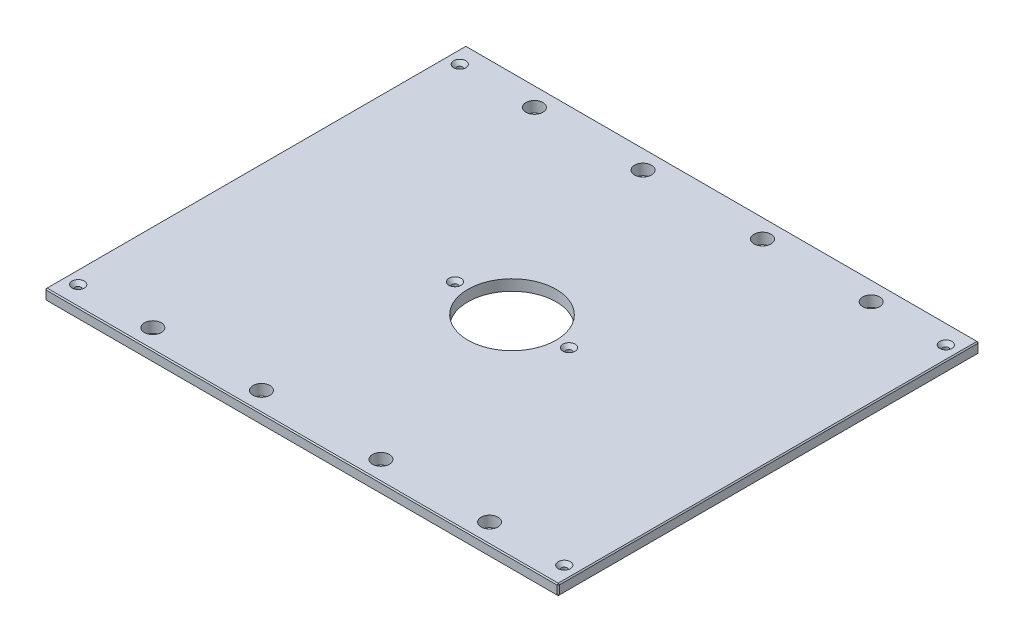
ISO-10303-21;
HEADER;
FILE_DESCRIPTION(('STEP AP214'),'2;1');
FILE_NAME('part.step','',(''),(''),'','','');
FILE_SCHEMA(('AUTOMOTIVE_DESIGN { 1 0 10303 214 1 1 1 1 }'));
ENDSEC;
DATA;
#1=APPLICATION_CONTEXT('core data for automotive mechanical design processes');
#2=APPLICATION_PROTOCOL_DEFINITION('international standard','automotive_design',2000,#1);
#3=PRODUCT_CONTEXT('',#1,'mechanical');
#4=PRODUCT('Part','Part','',(#3));
#5=PRODUCT_RELATED_PRODUCT_CATEGORY('part','',(#4));
#6=PRODUCT_DEFINITION_FORMATION('','',#4);
#7=PRODUCT_DEFINITION_CONTEXT('part definition',#1,'design');
#8=PRODUCT_DEFINITION('design','',#6,#7);
#9=PRODUCT_DEFINITION_SHAPE('','',#8);
#10=(LENGTH_UNIT() NAMED_UNIT(*) SI_UNIT(.MILLI.,.METRE.));
#11=(NAMED_UNIT(*) PLANE_ANGLE_UNIT() SI_UNIT($,.RADIAN.));
#12=(NAMED_UNIT(*) SI_UNIT($,.STERADIAN.) SOLID_ANGLE_UNIT());
#13=UNCERTAINTY_MEASURE_WITH_UNIT(LENGTH_MEASURE(1.E-05),#10,'distance_accuracy_value','');
#14=(GEOMETRIC_REPRESENTATION_CONTEXT(3) GLOBAL_UNCERTAINTY_ASSIGNED_CONTEXT((#13)) GLOBAL_UNIT_ASSIGNED_CONTEXT((#10,
#11,#12)) REPRESENTATION_CONTEXT('',''));
#15=CARTESIAN_POINT('',(0.,0.,0.));
#16=DIRECTION('',(0.,0.,1.));
#17=DIRECTION('',(1.,0.,0.));
#18=AXIS2_PLACEMENT_3D('',#15,#16,#17);
#19=CARTESIAN_POINT('',(-300.0375,12.7,-246.0625));
#20=DIRECTION('',(1.,0.,0.));
#21=DIRECTION('',(0.,0.,-1.));
#22=AXIS2_PLACEMENT_3D('',#19,#20,#21);
#23=PLANE('',#22);
#24=DIRECTION('',(0.,0.,-1.));
#25=VECTOR('',#24,1.);
#26=CARTESIAN_POINT('',(-300.0375,11.4300000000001,-246.0625));
#27=LINE('',#26,#25);
#28=CARTESIAN_POINT('',(-300.0375,11.4300000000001,244.7925));
#29=VERTEX_POINT('',#28);
#30=CARTESIAN_POINT('',(-300.0375,11.4300000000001,-244.7925));
#31=VERTEX_POINT('',#30);
#32=EDGE_CURVE('E135',#29,#31,#27,.T.);
#33=ORIENTED_EDGE('',*,*,#32,.T.);
#34=DIRECTION('',(0.,-1.,0.));
#35=VECTOR('',#34,1.);
#36=CARTESIAN_POINT('',(-300.0375,12.7,-244.7925));
#37=LINE('',#36,#35);
#38=CARTESIAN_POINT('',(-300.0375,1.26999999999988,-244.7925));
#39=VERTEX_POINT('',#38);
#40=EDGE_CURVE('E131',#31,#39,#37,.T.);
#41=ORIENTED_EDGE('',*,*,#40,.T.);
#42=DIRECTION('',(0.,0.,1.));
#43=VECTOR('',#42,1.);
#44=CARTESIAN_POINT('',(-300.0375,1.26999999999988,-246.0625));
#45=LINE('',#44,#43);
#46=CARTESIAN_POINT('',(-300.0375,1.26999999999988,244.7925));
#47=VERTEX_POINT('',#46);
#48=EDGE_CURVE('E126',#39,#47,#45,.T.);
#49=ORIENTED_EDGE('',*,*,#48,.T.);
#50=DIRECTION('',(0.,1.,0.));
#51=VECTOR('',#50,1.);
#52=CARTESIAN_POINT('',(-300.0375,12.7,244.7925));
#53=LINE('',#52,#51);
#54=EDGE_CURVE('E128',#47,#29,#53,.T.);
#55=ORIENTED_EDGE('',*,*,#54,.T.);
#56=EDGE_LOOP('',(#33,#41,#49,#55));
#57=FACE_BOUND('',#56,.T.);
#58=ADVANCED_FACE('F35',(#57),#23,.F.);
#59=CARTESIAN_POINT('',(-300.0375,12.7,246.0625));
#60=DIRECTION('',(0.,0.,-1.));
#61=DIRECTION('',(-1.,0.,0.));
#62=AXIS2_PLACEMENT_3D('',#59,#60,#61);
#63=PLANE('',#62);
#64=DIRECTION('',(1.,0.,0.));
#65=VECTOR('',#64,1.);
#66=CARTESIAN_POINT('',(-300.0375,1.26999999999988,246.0625));
#67=LINE('',#66,#65);
#68=CARTESIAN_POINT('',(-298.7675,1.26999999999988,246.0625));
#69=VERTEX_POINT('',#68);
#70=CARTESIAN_POINT('',(298.7675,1.26999999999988,246.0625));
#71=VERTEX_POINT('',#70);
#72=EDGE_CURVE('E58',#69,#71,#67,.T.);
#73=ORIENTED_EDGE('',*,*,#72,.T.);
#74=DIRECTION('',(0.,1.,0.));
#75=VECTOR('',#74,1.);
#76=CARTESIAN_POINT('',(298.7675,12.7,246.0625));
#77=LINE('',#76,#75);
#78=CARTESIAN_POINT('',(298.7675,11.4300000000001,246.0625));
#79=VERTEX_POINT('',#78);
#80=EDGE_CURVE('E11',#71,#79,#77,.T.);
#81=ORIENTED_EDGE('',*,*,#80,.T.);
#82=DIRECTION('',(-1.,0.,0.));
#83=VECTOR('',#82,1.);
#84=CARTESIAN_POINT('',(-300.0375,11.4300000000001,246.0625));
#85=LINE('',#84,#83);
#86=CARTESIAN_POINT('',(-298.7675,11.4300000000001,246.0625));
#87=VERTEX_POINT('',#86);
#88=EDGE_CURVE('E44',#79,#87,#85,.T.);
#89=ORIENTED_EDGE('',*,*,#88,.T.);
#90=DIRECTION('',(0.,-1.,0.));
#91=VECTOR('',#90,1.);
#92=CARTESIAN_POINT('',(-298.7675,12.7,246.0625));
#93=LINE('',#92,#91);
#94=EDGE_CURVE('E303',#87,#69,#93,.T.);
#95=ORIENTED_EDGE('',*,*,#94,.T.);
#96=EDGE_LOOP('',(#73,#81,#89,#95));
#97=FACE_BOUND('',#96,.T.);
#98=ADVANCED_FACE('F372',(#97),#63,.F.);
#99=CARTESIAN_POINT('',(300.0375,12.7,-246.0625));
#100=DIRECTION('',(-1.,0.,0.));
#101=DIRECTION('',(0.,0.,1.));
#102=AXIS2_PLACEMENT_3D('',#99,#100,#101);
#103=PLANE('',#102);
#104=DIRECTION('',(0.,0.,-1.));
#105=VECTOR('',#104,1.);
#106=CARTESIAN_POINT('',(300.0375,1.26999999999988,-246.0625));
#107=LINE('',#106,#105);
#108=CARTESIAN_POINT('',(300.0375,1.26999999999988,244.7925));
#109=VERTEX_POINT('',#108);
#110=CARTESIAN_POINT('',(300.0375,1.26999999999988,-244.7925));
#111=VERTEX_POINT('',#110);
#112=EDGE_CURVE('E298',#109,#111,#107,.T.);
#113=ORIENTED_EDGE('',*,*,#112,.T.);
#114=DIRECTION('',(0.,1.,0.));
#115=VECTOR('',#114,1.);
#116=CARTESIAN_POINT('',(300.0375,12.7,-244.7925));
#117=LINE('',#116,#115);
#118=CARTESIAN_POINT('',(300.0375,11.4300000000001,-244.7925));
#119=VERTEX_POINT('',#118);
#120=EDGE_CURVE('E300',#111,#119,#117,.T.);
#121=ORIENTED_EDGE('',*,*,#120,.T.);
#122=DIRECTION('',(0.,0.,1.));
#123=VECTOR('',#122,1.);
#124=CARTESIAN_POINT('',(300.0375,11.4300000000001,246.0625));
#125=LINE('',#124,#123);
#126=CARTESIAN_POINT('',(300.0375,11.4300000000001,244.7925));
#127=VERTEX_POINT('',#126);
#128=EDGE_CURVE('E296',#119,#127,#125,.T.);
#129=ORIENTED_EDGE('',*,*,#128,.T.);
#130=DIRECTION('',(0.,-1.,0.));
#131=VECTOR('',#130,1.);
#132=CARTESIAN_POINT('',(300.0375,12.7,244.7925));
#133=LINE('',#132,#131);
#134=EDGE_CURVE('E294',#127,#109,#133,.T.);
#135=ORIENTED_EDGE('',*,*,#134,.T.);
#136=EDGE_LOOP('',(#113,#121,#129,#135));
#137=FACE_BOUND('',#136,.T.);
#138=ADVANCED_FACE('F359',(#137),#103,.F.);
#139=CARTESIAN_POINT('',(-300.0375,12.7,-246.0625));
#140=DIRECTION('',(0.,0.,1.));
#141=DIRECTION('',(1.,0.,0.));
#142=AXIS2_PLACEMENT_3D('',#139,#140,#141);
#143=PLANE('',#142);
#144=DIRECTION('',(-1.,0.,0.));
#145=VECTOR('',#144,1.);
#146=CARTESIAN_POINT('',(-300.0375,1.26999999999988,-246.0625));
#147=LINE('',#146,#145);
#148=CARTESIAN_POINT('',(298.7675,1.26999999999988,-246.0625));
#149=VERTEX_POINT('',#148);
#150=CARTESIAN_POINT('',(-298.7675,1.26999999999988,-246.0625));
#151=VERTEX_POINT('',#150);
#152=EDGE_CURVE('E270',#149,#151,#147,.T.);
#153=ORIENTED_EDGE('',*,*,#152,.T.);
#154=DIRECTION('',(0.,1.,0.));
#155=VECTOR('',#154,1.);
#156=CARTESIAN_POINT('',(-298.7675,12.7,-246.0625));
#157=LINE('',#156,#155);
#158=CARTESIAN_POINT('',(-298.7675,11.4300000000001,-246.0625));
#159=VERTEX_POINT('',#158);
#160=EDGE_CURVE('E274',#151,#159,#157,.T.);
#161=ORIENTED_EDGE('',*,*,#160,.T.);
#162=DIRECTION('',(1.,0.,0.));
#163=VECTOR('',#162,1.);
#164=CARTESIAN_POINT('',(300.0375,11.4300000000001,-246.0625));
#165=LINE('',#164,#163);
#166=CARTESIAN_POINT('',(298.7675,11.4300000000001,-246.0625));
#167=VERTEX_POINT('',#166);
#168=EDGE_CURVE('E272',#159,#167,#165,.T.);
#169=ORIENTED_EDGE('',*,*,#168,.T.);
#170=DIRECTION('',(0.,-1.,0.));
#171=VECTOR('',#170,1.);
#172=CARTESIAN_POINT('',(298.7675,12.7,-246.0625));
#173=LINE('',#172,#171);
#174=EDGE_CURVE('E268',#167,#149,#173,.T.);
#175=ORIENTED_EDGE('',*,*,#174,.T.);
#176=EDGE_LOOP('',(#153,#161,#169,#175));
#177=FACE_BOUND('',#176,.T.);
#178=ADVANCED_FACE('F333',(#177),#143,.F.);
#179=CARTESIAN_POINT('',(0.,12.7,0.));
#180=DIRECTION('',(0.,1.,0.));
#181=DIRECTION('',(0.,0.,1.));
#182=AXIS2_PLACEMENT_3D('',#179,#180,#181);
#183=PLANE('',#182);
#184=CARTESIAN_POINT('',(284.1625,12.7,-223.04248));
#185=DIRECTION('',(0.,1.,0.));
#186=DIRECTION('',(0.,0.,1.));
#187=AXIS2_PLACEMENT_3D('',#184,#185,#186);
#188=CIRCLE('',#187,7.13740000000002);
#189=CARTESIAN_POINT('',(284.1625,12.7,-215.90508));
#190=VERTEX_POINT('',#189);
#191=EDGE_CURVE('E816',#190,#190,#188,.T.);
#192=ORIENTED_EDGE('',*,*,#191,.F.);
#193=EDGE_LOOP('',(#192));
#194=FACE_BOUND('',#193,.T.);
#195=CARTESIAN_POINT('',(284.1625,12.7,223.04248));
#196=DIRECTION('',(0.,1.,0.));
#197=DIRECTION('',(0.,0.,1.));
#198=AXIS2_PLACEMENT_3D('',#195,#196,#197);
#199=CIRCLE('',#198,7.13740000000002);
#200=CARTESIAN_POINT('',(284.1625,12.7,230.17988));
#201=VERTEX_POINT('',#200);
#202=EDGE_CURVE('E820',#201,#201,#199,.T.);
#203=ORIENTED_EDGE('',*,*,#202,.F.);
#204=EDGE_LOOP('',(#203));
#205=FACE_BOUND('',#204,.T.);
#206=CARTESIAN_POINT('',(-284.1625,12.7,223.04248));
#207=DIRECTION('',(0.,1.,0.));
#208=DIRECTION('',(0.,0.,1.));
#209=AXIS2_PLACEMENT_3D('',#206,#207,#208);
#210=CIRCLE('',#209,7.13740000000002);
#211=CARTESIAN_POINT('',(-284.1625,12.7,230.17988));
#212=VERTEX_POINT('',#211);
#213=EDGE_CURVE('E824',#212,#212,#210,.T.);
#214=ORIENTED_EDGE('',*,*,#213,.F.);
#215=EDGE_LOOP('',(#214));
#216=FACE_BOUND('',#215,.T.);
#217=CARTESIAN_POINT('',(-66.675,12.7,0.));
#218=DIRECTION('',(0.,1.,0.));
#219=DIRECTION('',(0.,0.,1.));
#220=AXIS2_PLACEMENT_3D('',#217,#218,#219);
#221=CIRCLE('',#220,7.1374);
#222=CARTESIAN_POINT('',(-66.675,12.7,7.1374));
#223=VERTEX_POINT('',#222);
#224=EDGE_CURVE('E828',#223,#223,#221,.T.);
#225=ORIENTED_EDGE('',*,*,#224,.F.);
#226=EDGE_LOOP('',(#225));
#227=FACE_BOUND('',#226,.T.);
#228=CARTESIAN_POINT('',(66.675,12.7,0.));
#229=DIRECTION('',(0.,1.,0.));
#230=DIRECTION('',(0.,0.,1.));
#231=AXIS2_PLACEMENT_3D('',#228,#229,#230);
#232=CIRCLE('',#231,7.1374);
#233=CARTESIAN_POINT('',(66.675,12.7,7.1374));
#234=VERTEX_POINT('',#233);
#235=EDGE_CURVE('E832',#234,#234,#232,.T.);
#236=ORIENTED_EDGE('',*,*,#235,.F.);
#237=EDGE_LOOP('',(#236));
#238=FACE_BOUND('',#237,.T.);
#239=CARTESIAN_POINT('',(-284.1625,12.7,-223.04248));
#240=DIRECTION('',(0.,1.,0.));
#241=DIRECTION('',(0.,0.,1.));
#242=AXIS2_PLACEMENT_3D('',#239,#240,#241);
#243=CIRCLE('',#242,7.13740000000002);
#244=CARTESIAN_POINT('',(-284.1625,12.7,-215.90508));
#245=VERTEX_POINT('',#244);
#246=EDGE_CURVE('E835',#245,#245,#243,.T.);
#247=ORIENTED_EDGE('',*,*,#246,.F.);
#248=EDGE_LOOP('',(#247));
#249=FACE_BOUND('',#248,.T.);
#250=DIRECTION('',(0.,0.,-1.));
#251=VECTOR('',#250,1.);
#252=CARTESIAN_POINT('',(298.7675,12.7,-246.0625));
#253=LINE('',#252,#251);
#254=CARTESIAN_POINT('',(298.7675,12.7,244.7925));
#255=VERTEX_POINT('',#254);
#256=CARTESIAN_POINT('',(298.7675,12.7,-244.7925));
#257=VERTEX_POINT('',#256);
#258=EDGE_CURVE('E281',#255,#257,#253,.T.);
#259=ORIENTED_EDGE('',*,*,#258,.T.);
#260=DIRECTION('',(-1.,0.,0.));
#261=VECTOR('',#260,1.);
#262=CARTESIAN_POINT('',(-300.0375,12.7,-244.7925));
#263=LINE('',#262,#261);
#264=CARTESIAN_POINT('',(-298.7675,12.7,-244.7925));
#265=VERTEX_POINT('',#264);
#266=EDGE_CURVE('E283',#257,#265,#263,.T.);
#267=ORIENTED_EDGE('',*,*,#266,.T.);
#268=DIRECTION('',(0.,0.,1.));
#269=VECTOR('',#268,1.);
#270=CARTESIAN_POINT('',(-298.7675,12.7,246.0625));
#271=LINE('',#270,#269);
#272=CARTESIAN_POINT('',(-298.7675,12.7,244.7925));
#273=VERTEX_POINT('',#272);
#274=EDGE_CURVE('E279',#265,#273,#271,.T.);
#275=ORIENTED_EDGE('',*,*,#274,.T.);
#276=DIRECTION('',(1.,0.,0.));
#277=VECTOR('',#276,1.);
#278=CARTESIAN_POINT('',(300.0375,12.7,244.7925));
#279=LINE('',#278,#277);
#280=EDGE_CURVE('E277',#273,#255,#279,.T.);
#281=ORIENTED_EDGE('',*,*,#280,.T.);
#282=EDGE_LOOP('',(#259,#267,#275,#281));
#283=FACE_BOUND('',#282,.T.);
#284=CARTESIAN_POINT('',(196.85,12.7,-223.04248));
#285=DIRECTION('',(0.,1.,0.));
#286=DIRECTION('',(0.,0.,1.));
#287=AXIS2_PLACEMENT_3D('',#284,#285,#286);
#288=CIRCLE('',#287,9.921875);
#289=CARTESIAN_POINT('',(196.85,12.7,-213.120605));
#290=VERTEX_POINT('',#289);
#291=EDGE_CURVE('E204',#290,#290,#288,.T.);
#292=ORIENTED_EDGE('',*,*,#291,.F.);
#293=EDGE_LOOP('',(#292));
#294=FACE_BOUND('',#293,.T.);
#295=CARTESIAN_POINT('',(-196.85,12.7,-223.04248));
#296=DIRECTION('',(0.,1.,0.));
#297=DIRECTION('',(0.,0.,1.));
#298=AXIS2_PLACEMENT_3D('',#295,#296,#297);
#299=CIRCLE('',#298,9.921875);
#300=CARTESIAN_POINT('',(-196.85,12.7,-213.120605));
#301=VERTEX_POINT('',#300);
#302=EDGE_CURVE('E214',#301,#301,#299,.T.);
#303=ORIENTED_EDGE('',*,*,#302,.F.);
#304=EDGE_LOOP('',(#303));
#305=FACE_BOUND('',#304,.T.);
#306=CARTESIAN_POINT('',(196.85,12.7,223.04248));
#307=DIRECTION('',(0.,1.,0.));
#308=DIRECTION('',(0.,0.,1.));
#309=AXIS2_PLACEMENT_3D('',#306,#307,#308);
#310=CIRCLE('',#309,9.921875);
#311=CARTESIAN_POINT('',(196.85,12.7,232.964355));
#312=VERTEX_POINT('',#311);
#313=EDGE_CURVE('E225',#312,#312,#310,.T.);
#314=ORIENTED_EDGE('',*,*,#313,.F.);
#315=EDGE_LOOP('',(#314));
#316=FACE_BOUND('',#315,.T.);
#317=CARTESIAN_POINT('',(-196.85,12.7,223.04248));
#318=DIRECTION('',(0.,1.,0.));
#319=DIRECTION('',(0.,0.,1.));
#320=AXIS2_PLACEMENT_3D('',#317,#318,#319);
#321=CIRCLE('',#320,9.921875);
#322=CARTESIAN_POINT('',(-196.85,12.7,232.964355));
#323=VERTEX_POINT('',#322);
#324=EDGE_CURVE('E231',#323,#323,#321,.T.);
#325=ORIENTED_EDGE('',*,*,#324,.F.);
#326=EDGE_LOOP('',(#325));
#327=FACE_BOUND('',#326,.T.);
#328=CARTESIAN_POINT('',(-69.85,12.7,-223.04248));
#329=DIRECTION('',(0.,1.,0.));
#330=DIRECTION('',(0.,0.,1.));
#331=AXIS2_PLACEMENT_3D('',#328,#329,#330);
#332=CIRCLE('',#331,9.921875);
#333=CARTESIAN_POINT('',(-69.85,12.7,-213.120605));
#334=VERTEX_POINT('',#333);
#335=EDGE_CURVE('E237',#334,#334,#332,.T.);
#336=ORIENTED_EDGE('',*,*,#335,.F.);
#337=EDGE_LOOP('',(#336));
#338=FACE_BOUND('',#337,.T.);
#339=CARTESIAN_POINT('',(69.85,12.7,-223.04248));
#340=DIRECTION('',(0.,1.,0.));
#341=DIRECTION('',(0.,0.,1.));
#342=AXIS2_PLACEMENT_3D('',#339,#340,#341);
#343=CIRCLE('',#342,9.921875);
#344=CARTESIAN_POINT('',(69.85,12.7,-213.120605));
#345=VERTEX_POINT('',#344);
#346=EDGE_CURVE('E243',#345,#345,#343,.T.);
#347=ORIENTED_EDGE('',*,*,#346,.F.);
#348=EDGE_LOOP('',(#347));
#349=FACE_BOUND('',#348,.T.);
#350=CARTESIAN_POINT('',(69.85,12.7,223.04248));
#351=DIRECTION('',(0.,1.,0.));
#352=DIRECTION('',(0.,0.,1.));
#353=AXIS2_PLACEMENT_3D('',#350,#351,#352);
#354=CIRCLE('',#353,9.921875);
#355=CARTESIAN_POINT('',(69.85,12.7,232.964355));
#356=VERTEX_POINT('',#355);
#357=EDGE_CURVE('E249',#356,#356,#354,.T.);
#358=ORIENTED_EDGE('',*,*,#357,.F.);
#359=EDGE_LOOP('',(#358));
#360=FACE_BOUND('',#359,.T.);
#361=CARTESIAN_POINT('',(-69.85,12.7,223.04248));
#362=DIRECTION('',(0.,1.,0.));
#363=DIRECTION('',(0.,0.,1.));
#364=AXIS2_PLACEMENT_3D('',#361,#362,#363);
#365=CIRCLE('',#364,9.921875);
#366=CARTESIAN_POINT('',(-69.85,12.7,232.964355));
#367=VERTEX_POINT('',#366);
#368=EDGE_CURVE('E255',#367,#367,#365,.T.);
#369=ORIENTED_EDGE('',*,*,#368,.F.);
#370=EDGE_LOOP('',(#369));
#371=FACE_BOUND('',#370,.T.);
#372=CARTESIAN_POINT('',(0.,12.7,0.));
#373=DIRECTION('',(0.,1.,0.));
#374=DIRECTION('',(0.,0.,1.));
#375=AXIS2_PLACEMENT_3D('',#372,#373,#374);
#376=CIRCLE('',#375,51.562);
#377=CARTESIAN_POINT('',(0.,12.7,51.562));
#378=VERTEX_POINT('',#377);
#379=EDGE_CURVE('E261',#378,#378,#376,.T.);
#380=ORIENTED_EDGE('',*,*,#379,.F.);
#381=EDGE_LOOP('',(#380));
#382=FACE_BOUND('',#381,.T.);
#383=ADVANCED_FACE('F381',(#194,#205,#216,#227,#238,#249,#283,#294,#305,#316,#327,#338,#349,
#360,#371,#382),#183,.T.);
#384=CARTESIAN_POINT('',(0.,0.,0.));
#385=DIRECTION('',(0.,1.,0.));
#386=DIRECTION('',(0.,0.,1.));
#387=AXIS2_PLACEMENT_3D('',#384,#385,#386);
#388=PLANE('',#387);
#389=CARTESIAN_POINT('',(284.1625,0.,-223.04248));
#390=DIRECTION('',(0.,1.,0.));
#391=DIRECTION('',(0.,0.,1.));
#392=AXIS2_PLACEMENT_3D('',#389,#390,#391);
#393=CIRCLE('',#392,3.3782);
#394=CARTESIAN_POINT('',(284.1625,0.,-219.66428));
#395=VERTEX_POINT('',#394);
#396=EDGE_CURVE('E869',#395,#395,#393,.T.);
#397=ORIENTED_EDGE('',*,*,#396,.T.);
#398=EDGE_LOOP('',(#397));
#399=FACE_BOUND('',#398,.T.);
#400=CARTESIAN_POINT('',(284.1625,0.,223.04248));
#401=DIRECTION('',(0.,1.,0.));
#402=DIRECTION('',(0.,0.,1.));
#403=AXIS2_PLACEMENT_3D('',#400,#401,#402);
#404=CIRCLE('',#403,3.3782);
#405=CARTESIAN_POINT('',(284.1625,0.,226.42068));
#406=VERTEX_POINT('',#405);
#407=EDGE_CURVE('E862',#406,#406,#404,.T.);
#408=ORIENTED_EDGE('',*,*,#407,.T.);
#409=EDGE_LOOP('',(#408));
#410=FACE_BOUND('',#409,.T.);
#411=CARTESIAN_POINT('',(-284.1625,0.,223.04248));
#412=DIRECTION('',(0.,1.,0.));
#413=DIRECTION('',(0.,0.,1.));
#414=AXIS2_PLACEMENT_3D('',#411,#412,#413);
#415=CIRCLE('',#414,3.3782);
#416=CARTESIAN_POINT('',(-284.1625,0.,226.42068));
#417=VERTEX_POINT('',#416);
#418=EDGE_CURVE('E855',#417,#417,#415,.T.);
#419=ORIENTED_EDGE('',*,*,#418,.T.);
#420=EDGE_LOOP('',(#419));
#421=FACE_BOUND('',#420,.T.);
#422=CARTESIAN_POINT('',(-66.675,0.,0.));
#423=DIRECTION('',(0.,1.,0.));
#424=DIRECTION('',(0.,0.,1.));
#425=AXIS2_PLACEMENT_3D('',#422,#423,#424);
#426=CIRCLE('',#425,3.3782);
#427=CARTESIAN_POINT('',(-66.675,0.,3.3782));
#428=VERTEX_POINT('',#427);
#429=EDGE_CURVE('E848',#428,#428,#426,.T.);
#430=ORIENTED_EDGE('',*,*,#429,.T.);
#431=EDGE_LOOP('',(#430));
#432=FACE_BOUND('',#431,.T.);
#433=CARTESIAN_POINT('',(66.675,0.,0.));
#434=DIRECTION('',(0.,1.,0.));
#435=DIRECTION('',(0.,0.,1.));
#436=AXIS2_PLACEMENT_3D('',#433,#434,#435);
#437=CIRCLE('',#436,3.3782);
#438=CARTESIAN_POINT('',(66.675,0.,3.3782));
#439=VERTEX_POINT('',#438);
#440=EDGE_CURVE('E838',#439,#439,#437,.T.);
#441=ORIENTED_EDGE('',*,*,#440,.T.);
#442=EDGE_LOOP('',(#441));
#443=FACE_BOUND('',#442,.T.);
#444=CARTESIAN_POINT('',(-284.1625,0.,-223.04248));
#445=DIRECTION('',(0.,1.,0.));
#446=DIRECTION('',(0.,0.,1.));
#447=AXIS2_PLACEMENT_3D('',#444,#445,#446);
#448=CIRCLE('',#447,3.3782);
#449=CARTESIAN_POINT('',(-284.1625,0.,-219.66428));
#450=VERTEX_POINT('',#449);
#451=EDGE_CURVE('E217',#450,#450,#448,.T.);
#452=ORIENTED_EDGE('',*,*,#451,.T.);
#453=EDGE_LOOP('',(#452));
#454=FACE_BOUND('',#453,.T.);
#455=DIRECTION('',(0.,0.,-1.));
#456=VECTOR('',#455,1.);
#457=CARTESIAN_POINT('',(-298.7675,0.,0.));
#458=LINE('',#457,#456);
#459=CARTESIAN_POINT('',(-298.7675,0.,244.7925));
#460=VERTEX_POINT('',#459);
#461=CARTESIAN_POINT('',(-298.7675,0.,-244.7925));
#462=VERTEX_POINT('',#461);
#463=EDGE_CURVE('E158',#460,#462,#458,.T.);
#464=ORIENTED_EDGE('',*,*,#463,.T.);
#465=DIRECTION('',(1.,0.,0.));
#466=VECTOR('',#465,1.);
#467=CARTESIAN_POINT('',(0.,0.,-244.7925));
#468=LINE('',#467,#466);
#469=CARTESIAN_POINT('',(298.7675,0.,-244.7925));
#470=VERTEX_POINT('',#469);
#471=EDGE_CURVE('E291',#462,#470,#468,.T.);
#472=ORIENTED_EDGE('',*,*,#471,.T.);
#473=DIRECTION('',(0.,0.,1.));
#474=VECTOR('',#473,1.);
#475=CARTESIAN_POINT('',(298.7675,0.,0.));
#476=LINE('',#475,#474);
#477=CARTESIAN_POINT('',(298.7675,0.,244.7925));
#478=VERTEX_POINT('',#477);
#479=EDGE_CURVE('E289',#470,#478,#476,.T.);
#480=ORIENTED_EDGE('',*,*,#479,.T.);
#481=DIRECTION('',(-1.,0.,0.));
#482=VECTOR('',#481,1.);
#483=CARTESIAN_POINT('',(0.,0.,244.7925));
#484=LINE('',#483,#482);
#485=EDGE_CURVE('E286',#478,#460,#484,.T.);
#486=ORIENTED_EDGE('',*,*,#485,.T.);
#487=EDGE_LOOP('',(#464,#472,#480,#486));
#488=FACE_BOUND('',#487,.T.);
#489=CARTESIAN_POINT('',(196.85,0.,-223.04248));
#490=DIRECTION('',(0.,1.,0.));
#491=DIRECTION('',(0.,0.,1.));
#492=AXIS2_PLACEMENT_3D('',#489,#490,#491);
#493=CIRCLE('',#492,9.921875);
#494=CARTESIAN_POINT('',(196.85,0.,-213.120605));
#495=VERTEX_POINT('',#494);
#496=EDGE_CURVE('E209',#495,#495,#493,.T.);
#497=ORIENTED_EDGE('',*,*,#496,.T.);
#498=EDGE_LOOP('',(#497));
#499=FACE_BOUND('',#498,.T.);
#500=CARTESIAN_POINT('',(-196.85,0.,-223.04248));
#501=DIRECTION('',(0.,1.,0.));
#502=DIRECTION('',(0.,0.,1.));
#503=AXIS2_PLACEMENT_3D('',#500,#501,#502);
#504=CIRCLE('',#503,9.921875);
#505=CARTESIAN_POINT('',(-196.85,0.,-213.120605));
#506=VERTEX_POINT('',#505);
#507=EDGE_CURVE('E222',#506,#506,#504,.T.);
#508=ORIENTED_EDGE('',*,*,#507,.T.);
#509=EDGE_LOOP('',(#508));
#510=FACE_BOUND('',#509,.T.);
#511=CARTESIAN_POINT('',(196.85,0.,223.04248));
#512=DIRECTION('',(0.,1.,0.));
#513=DIRECTION('',(0.,0.,1.));
#514=AXIS2_PLACEMENT_3D('',#511,#512,#513);
#515=CIRCLE('',#514,9.921875);
#516=CARTESIAN_POINT('',(196.85,0.,232.964355));
#517=VERTEX_POINT('',#516);
#518=EDGE_CURVE('E228',#517,#517,#515,.T.);
#519=ORIENTED_EDGE('',*,*,#518,.T.);
#520=EDGE_LOOP('',(#519));
#521=FACE_BOUND('',#520,.T.);
#522=CARTESIAN_POINT('',(-196.85,0.,223.04248));
#523=DIRECTION('',(0.,1.,0.));
#524=DIRECTION('',(0.,0.,1.));
#525=AXIS2_PLACEMENT_3D('',#522,#523,#524);
#526=CIRCLE('',#525,9.921875);
#527=CARTESIAN_POINT('',(-196.85,0.,232.964355));
#528=VERTEX_POINT('',#527);
#529=EDGE_CURVE('E234',#528,#528,#526,.T.);
#530=ORIENTED_EDGE('',*,*,#529,.T.);
#531=EDGE_LOOP('',(#530));
#532=FACE_BOUND('',#531,.T.);
#533=CARTESIAN_POINT('',(-69.85,0.,-223.04248));
#534=DIRECTION('',(0.,1.,0.));
#535=DIRECTION('',(0.,0.,1.));
#536=AXIS2_PLACEMENT_3D('',#533,#534,#535);
#537=CIRCLE('',#536,9.921875);
#538=CARTESIAN_POINT('',(-69.85,0.,-213.120605));
#539=VERTEX_POINT('',#538);
#540=EDGE_CURVE('E240',#539,#539,#537,.T.);
#541=ORIENTED_EDGE('',*,*,#540,.T.);
#542=EDGE_LOOP('',(#541));
#543=FACE_BOUND('',#542,.T.);
#544=CARTESIAN_POINT('',(69.85,0.,-223.04248));
#545=DIRECTION('',(0.,1.,0.));
#546=DIRECTION('',(0.,0.,1.));
#547=AXIS2_PLACEMENT_3D('',#544,#545,#546);
#548=CIRCLE('',#547,9.921875);
#549=CARTESIAN_POINT('',(69.85,0.,-213.120605));
#550=VERTEX_POINT('',#549);
#551=EDGE_CURVE('E246',#550,#550,#548,.T.);
#552=ORIENTED_EDGE('',*,*,#551,.T.);
#553=EDGE_LOOP('',(#552));
#554=FACE_BOUND('',#553,.T.);
#555=CARTESIAN_POINT('',(69.85,0.,223.04248));
#556=DIRECTION('',(0.,1.,0.));
#557=DIRECTION('',(0.,0.,1.));
#558=AXIS2_PLACEMENT_3D('',#555,#556,#557);
#559=CIRCLE('',#558,9.921875);
#560=CARTESIAN_POINT('',(69.85,0.,232.964355));
#561=VERTEX_POINT('',#560);
#562=EDGE_CURVE('E252',#561,#561,#559,.T.);
#563=ORIENTED_EDGE('',*,*,#562,.T.);
#564=EDGE_LOOP('',(#563));
#565=FACE_BOUND('',#564,.T.);
#566=CARTESIAN_POINT('',(-69.85,0.,223.04248));
#567=DIRECTION('',(0.,1.,0.));
#568=DIRECTION('',(0.,0.,1.));
#569=AXIS2_PLACEMENT_3D('',#566,#567,#568);
#570=CIRCLE('',#569,9.921875);
#571=CARTESIAN_POINT('',(-69.85,0.,232.964355));
#572=VERTEX_POINT('',#571);
#573=EDGE_CURVE('E258',#572,#572,#570,.T.);
#574=ORIENTED_EDGE('',*,*,#573,.T.);
#575=EDGE_LOOP('',(#574));
#576=FACE_BOUND('',#575,.T.);
#577=CARTESIAN_POINT('',(0.,0.,0.));
#578=DIRECTION('',(0.,1.,0.));
#579=DIRECTION('',(0.,0.,1.));
#580=AXIS2_PLACEMENT_3D('',#577,#578,#579);
#581=CIRCLE('',#580,51.562);
#582=CARTESIAN_POINT('',(0.,0.,51.562));
#583=VERTEX_POINT('',#582);
#584=EDGE_CURVE('E147',#583,#583,#581,.T.);
#585=ORIENTED_EDGE('',*,*,#584,.T.);
#586=EDGE_LOOP('',(#585));
#587=FACE_BOUND('',#586,.T.);
#588=ADVANCED_FACE('F346',(#399,#410,#421,#432,#443,#454,#488,#499,#510,#521,#532,#543,#554,
#565,#576,#587),#388,.F.);
#589=CARTESIAN_POINT('',(0.,0.,0.));
#590=DIRECTION('',(0.,1.,0.));
#591=DIRECTION('',(0.,0.,1.));
#592=AXIS2_PLACEMENT_3D('',#589,#590,#591);
#593=CYLINDRICAL_SURFACE('',#592,51.562);
#594=ORIENTED_EDGE('',*,*,#584,.F.);
#595=EDGE_LOOP('',(#594));
#596=FACE_BOUND('',#595,.T.);
#597=ORIENTED_EDGE('',*,*,#379,.T.);
#598=EDGE_LOOP('',(#597));
#599=FACE_BOUND('',#598,.T.);
#600=ADVANCED_FACE('F751',(#596,#599),#593,.F.);
#601=CARTESIAN_POINT('',(-69.85,12.7,223.04248));
#602=DIRECTION('',(0.,1.,0.));
#603=DIRECTION('',(0.,0.,1.));
#604=AXIS2_PLACEMENT_3D('',#601,#602,#603);
#605=CYLINDRICAL_SURFACE('',#604,9.921875);
#606=ORIENTED_EDGE('',*,*,#573,.F.);
#607=EDGE_LOOP('',(#606));
#608=FACE_BOUND('',#607,.T.);
#609=ORIENTED_EDGE('',*,*,#368,.T.);
#610=EDGE_LOOP('',(#609));
#611=FACE_BOUND('',#610,.T.);
#612=ADVANCED_FACE('F742',(#608,#611),#605,.F.);
#613=CARTESIAN_POINT('',(69.85,12.7,223.04248));
#614=DIRECTION('',(0.,1.,0.));
#615=DIRECTION('',(0.,0.,1.));
#616=AXIS2_PLACEMENT_3D('',#613,#614,#615);
#617=CYLINDRICAL_SURFACE('',#616,9.921875);
#618=ORIENTED_EDGE('',*,*,#562,.F.);
#619=EDGE_LOOP('',(#618));
#620=FACE_BOUND('',#619,.T.);
#621=ORIENTED_EDGE('',*,*,#357,.T.);
#622=EDGE_LOOP('',(#621));
#623=FACE_BOUND('',#622,.T.);
#624=ADVANCED_FACE('F733',(#620,#623),#617,.F.);
#625=CARTESIAN_POINT('',(69.85,12.7,-223.04248));
#626=DIRECTION('',(0.,1.,0.));
#627=DIRECTION('',(0.,0.,1.));
#628=AXIS2_PLACEMENT_3D('',#625,#626,#627);
#629=CYLINDRICAL_SURFACE('',#628,9.921875);
#630=ORIENTED_EDGE('',*,*,#551,.F.);
#631=EDGE_LOOP('',(#630));
#632=FACE_BOUND('',#631,.T.);
#633=ORIENTED_EDGE('',*,*,#346,.T.);
#634=EDGE_LOOP('',(#633));
#635=FACE_BOUND('',#634,.T.);
#636=ADVANCED_FACE('F724',(#632,#635),#629,.F.);
#637=CARTESIAN_POINT('',(-69.85,12.7,-223.04248));
#638=DIRECTION('',(0.,1.,0.));
#639=DIRECTION('',(0.,0.,1.));
#640=AXIS2_PLACEMENT_3D('',#637,#638,#639);
#641=CYLINDRICAL_SURFACE('',#640,9.921875);
#642=ORIENTED_EDGE('',*,*,#540,.F.);
#643=EDGE_LOOP('',(#642));
#644=FACE_BOUND('',#643,.T.);
#645=ORIENTED_EDGE('',*,*,#335,.T.);
#646=EDGE_LOOP('',(#645));
#647=FACE_BOUND('',#646,.T.);
#648=ADVANCED_FACE('F715',(#644,#647),#641,.F.);
#649=CARTESIAN_POINT('',(-196.85,12.7,223.04248));
#650=DIRECTION('',(0.,1.,0.));
#651=DIRECTION('',(0.,0.,1.));
#652=AXIS2_PLACEMENT_3D('',#649,#650,#651);
#653=CYLINDRICAL_SURFACE('',#652,9.921875);
#654=ORIENTED_EDGE('',*,*,#529,.F.);
#655=EDGE_LOOP('',(#654));
#656=FACE_BOUND('',#655,.T.);
#657=ORIENTED_EDGE('',*,*,#324,.T.);
#658=EDGE_LOOP('',(#657));
#659=FACE_BOUND('',#658,.T.);
#660=ADVANCED_FACE('F706',(#656,#659),#653,.F.);
#661=CARTESIAN_POINT('',(196.85,12.7,223.04248));
#662=DIRECTION('',(0.,1.,0.));
#663=DIRECTION('',(0.,0.,1.));
#664=AXIS2_PLACEMENT_3D('',#661,#662,#663);
#665=CYLINDRICAL_SURFACE('',#664,9.921875);
#666=ORIENTED_EDGE('',*,*,#518,.F.);
#667=EDGE_LOOP('',(#666));
#668=FACE_BOUND('',#667,.T.);
#669=ORIENTED_EDGE('',*,*,#313,.T.);
#670=EDGE_LOOP('',(#669));
#671=FACE_BOUND('',#670,.T.);
#672=ADVANCED_FACE('F697',(#668,#671),#665,.F.);
#673=CARTESIAN_POINT('',(-196.85,12.7,-223.04248));
#674=DIRECTION('',(0.,1.,0.));
#675=DIRECTION('',(0.,0.,1.));
#676=AXIS2_PLACEMENT_3D('',#673,#674,#675);
#677=CYLINDRICAL_SURFACE('',#676,9.921875);
#678=ORIENTED_EDGE('',*,*,#507,.F.);
#679=EDGE_LOOP('',(#678));
#680=FACE_BOUND('',#679,.T.);
#681=ORIENTED_EDGE('',*,*,#302,.T.);
#682=EDGE_LOOP('',(#681));
#683=FACE_BOUND('',#682,.T.);
#684=ADVANCED_FACE('F687',(#680,#683),#677,.F.);
#685=CARTESIAN_POINT('',(196.85,12.7,-223.04248));
#686=DIRECTION('',(0.,1.,0.));
#687=DIRECTION('',(0.,0.,1.));
#688=AXIS2_PLACEMENT_3D('',#685,#686,#687);
#689=CYLINDRICAL_SURFACE('',#688,9.921875);
#690=ORIENTED_EDGE('',*,*,#496,.F.);
#691=EDGE_LOOP('',(#690));
#692=FACE_BOUND('',#691,.T.);
#693=ORIENTED_EDGE('',*,*,#291,.T.);
#694=EDGE_LOOP('',(#693));
#695=FACE_BOUND('',#694,.T.);
#696=ADVANCED_FACE('F390',(#692,#695),#689,.F.);
#697=CARTESIAN_POINT('',(300.0375,12.7,244.7925));
#698=DIRECTION('',(-0.707106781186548,0.,-0.707106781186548));
#699=DIRECTION('',(0.,-1.,0.));
#700=AXIS2_PLACEMENT_3D('',#697,#698,#699);
#701=PLANE('',#700);
#702=DIRECTION('',(-0.707106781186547,0.,0.707106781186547));
#703=VECTOR('',#702,1.);
#704=CARTESIAN_POINT('',(300.0375,11.4300000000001,244.7925));
#705=LINE('',#704,#703);
#706=EDGE_CURVE('E39',#79,#127,#705,.F.);
#707=ORIENTED_EDGE('',*,*,#706,.F.);
#708=ORIENTED_EDGE('',*,*,#80,.F.);
#709=DIRECTION('',(0.707106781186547,0.,-0.707106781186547));
#710=VECTOR('',#709,1.);
#711=CARTESIAN_POINT('',(299.4025,1.26999999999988,245.4275));
#712=LINE('',#711,#710);
#713=EDGE_CURVE('E197',#109,#71,#712,.F.);
#714=ORIENTED_EDGE('',*,*,#713,.F.);
#715=ORIENTED_EDGE('',*,*,#134,.F.);
#716=EDGE_LOOP('',(#707,#708,#714,#715));
#717=FACE_BOUND('',#716,.T.);
#718=ADVANCED_FACE('F37',(#717),#701,.F.);
#719=CARTESIAN_POINT('',(300.0375,11.4300000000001,244.7925));
#720=DIRECTION('',(0.577350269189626,0.577350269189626,0.577350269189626));
#721=DIRECTION('',(0.707106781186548,0.,-0.707106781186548));
#722=AXIS2_PLACEMENT_3D('',#719,#720,#721);
#723=PLANE('',#722);
#724=DIRECTION('',(0.,-0.707106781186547,0.707106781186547));
#725=VECTOR('',#724,1.);
#726=CARTESIAN_POINT('',(298.7675,12.0650000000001,245.4275));
#727=LINE('',#726,#725);
#728=EDGE_CURVE('E193',#79,#255,#727,.F.);
#729=ORIENTED_EDGE('',*,*,#728,.F.);
#730=ORIENTED_EDGE('',*,*,#706,.T.);
#731=DIRECTION('',(-0.707106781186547,0.707106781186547,0.));
#732=VECTOR('',#731,1.);
#733=CARTESIAN_POINT('',(300.0375,11.4300000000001,244.7925));
#734=LINE('',#733,#732);
#735=EDGE_CURVE('E195',#255,#127,#734,.F.);
#736=ORIENTED_EDGE('',*,*,#735,.F.);
#737=EDGE_LOOP('',(#729,#730,#736));
#738=FACE_BOUND('',#737,.T.);
#739=ADVANCED_FACE('F383',(#738),#723,.T.);
#740=CARTESIAN_POINT('',(298.7675,0.,244.7925));
#741=DIRECTION('',(0.577350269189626,-0.577350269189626,0.577350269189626));
#742=DIRECTION('',(0.707106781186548,0.,-0.707106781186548));
#743=AXIS2_PLACEMENT_3D('',#740,#741,#742);
#744=PLANE('',#743);
#745=DIRECTION('',(-0.707106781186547,-0.707106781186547,0.));
#746=VECTOR('',#745,1.);
#747=CARTESIAN_POINT('',(298.7675,0.,244.7925));
#748=LINE('',#747,#746);
#749=EDGE_CURVE('E187',#109,#478,#748,.T.);
#750=ORIENTED_EDGE('',*,*,#749,.F.);
#751=ORIENTED_EDGE('',*,*,#713,.T.);
#752=DIRECTION('',(0.,0.707106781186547,0.707106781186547));
#753=VECTOR('',#752,1.);
#754=CARTESIAN_POINT('',(298.7675,0.,244.7925));
#755=LINE('',#754,#753);
#756=EDGE_CURVE('E190',#478,#71,#755,.T.);
#757=ORIENTED_EDGE('',*,*,#756,.F.);
#758=EDGE_LOOP('',(#750,#751,#757));
#759=FACE_BOUND('',#758,.T.);
#760=ADVANCED_FACE('F352',(#759),#744,.T.);
#761=CARTESIAN_POINT('',(298.7675,12.7,0.));
#762=DIRECTION('',(0.707106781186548,0.707106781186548,0.));
#763=DIRECTION('',(0.,0.,1.));
#764=AXIS2_PLACEMENT_3D('',#761,#762,#763);
#765=PLANE('',#764);
#766=ORIENTED_EDGE('',*,*,#735,.T.);
#767=ORIENTED_EDGE('',*,*,#128,.F.);
#768=DIRECTION('',(0.707106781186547,-0.707106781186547,0.));
#769=VECTOR('',#768,1.);
#770=CARTESIAN_POINT('',(299.4025,12.0650000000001,-244.7925));
#771=LINE('',#770,#769);
#772=EDGE_CURVE('E182',#257,#119,#771,.T.);
#773=ORIENTED_EDGE('',*,*,#772,.F.);
#774=ORIENTED_EDGE('',*,*,#258,.F.);
#775=EDGE_LOOP('',(#766,#767,#773,#774));
#776=FACE_BOUND('',#775,.T.);
#777=ADVANCED_FACE('F369',(#776),#765,.T.);
#778=CARTESIAN_POINT('',(0.,12.7,244.7925));
#779=DIRECTION('',(0.,0.707106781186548,0.707106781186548));
#780=DIRECTION('',(-1.,0.,0.));
#781=AXIS2_PLACEMENT_3D('',#778,#779,#780);
#782=PLANE('',#781);
#783=ORIENTED_EDGE('',*,*,#728,.T.);
#784=ORIENTED_EDGE('',*,*,#280,.F.);
#785=DIRECTION('',(0.,0.707106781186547,-0.707106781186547));
#786=VECTOR('',#785,1.);
#787=CARTESIAN_POINT('',(-298.7675,12.7,244.7925));
#788=LINE('',#787,#786);
#789=EDGE_CURVE('E179',#87,#273,#788,.T.);
#790=ORIENTED_EDGE('',*,*,#789,.F.);
#791=ORIENTED_EDGE('',*,*,#88,.F.);
#792=EDGE_LOOP('',(#783,#784,#790,#791));
#793=FACE_BOUND('',#792,.T.);
#794=ADVANCED_FACE('F374',(#793),#782,.T.);
#795=CARTESIAN_POINT('',(-298.7675,12.7,246.0625));
#796=DIRECTION('',(0.707106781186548,0.,-0.707106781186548));
#797=DIRECTION('',(0.,-1.,0.));
#798=AXIS2_PLACEMENT_3D('',#795,#796,#797);
#799=PLANE('',#798);
#800=DIRECTION('',(0.707106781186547,0.,0.707106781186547));
#801=VECTOR('',#800,1.);
#802=CARTESIAN_POINT('',(-300.0375,1.26999999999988,244.7925));
#803=LINE('',#802,#801);
#804=EDGE_CURVE('E142',#69,#47,#803,.F.);
#805=ORIENTED_EDGE('',*,*,#804,.F.);
#806=ORIENTED_EDGE('',*,*,#94,.F.);
#807=DIRECTION('',(-0.707106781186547,0.,-0.707106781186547));
#808=VECTOR('',#807,1.);
#809=CARTESIAN_POINT('',(-299.4025,11.4300000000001,245.4275));
#810=LINE('',#809,#808);
#811=EDGE_CURVE('E145',#29,#87,#810,.F.);
#812=ORIENTED_EDGE('',*,*,#811,.F.);
#813=ORIENTED_EDGE('',*,*,#54,.F.);
#814=EDGE_LOOP('',(#805,#806,#812,#813));
#815=FACE_BOUND('',#814,.T.);
#816=ADVANCED_FACE('F140',(#815),#799,.F.);
#817=CARTESIAN_POINT('',(-300.0375,1.26999999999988,246.0625));
#818=DIRECTION('',(0.,0.707106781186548,-0.707106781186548));
#819=DIRECTION('',(1.,0.,0.));
#820=AXIS2_PLACEMENT_3D('',#817,#818,#819);
#821=PLANE('',#820);
#822=ORIENTED_EDGE('',*,*,#756,.T.);
#823=ORIENTED_EDGE('',*,*,#72,.F.);
#824=DIRECTION('',(0.,-0.707106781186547,-0.707106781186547));
#825=VECTOR('',#824,1.);
#826=CARTESIAN_POINT('',(-298.7675,0.634999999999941,245.4275));
#827=LINE('',#826,#825);
#828=EDGE_CURVE('E155',#460,#69,#827,.F.);
#829=ORIENTED_EDGE('',*,*,#828,.F.);
#830=ORIENTED_EDGE('',*,*,#485,.F.);
#831=EDGE_LOOP('',(#822,#823,#829,#830));
#832=FACE_BOUND('',#831,.T.);
#833=ADVANCED_FACE('F351',(#832),#821,.F.);
#834=CARTESIAN_POINT('',(300.0375,1.26999999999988,-246.0625));
#835=DIRECTION('',(-0.707106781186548,0.707106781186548,0.));
#836=DIRECTION('',(0.,0.,-1.));
#837=AXIS2_PLACEMENT_3D('',#834,#835,#836);
#838=PLANE('',#837);
#839=ORIENTED_EDGE('',*,*,#749,.T.);
#840=ORIENTED_EDGE('',*,*,#479,.F.);
#841=DIRECTION('',(0.707106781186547,0.707106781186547,0.));
#842=VECTOR('',#841,1.);
#843=CARTESIAN_POINT('',(298.7675,0.,-244.7925));
#844=LINE('',#843,#842);
#845=EDGE_CURVE('E174',#111,#470,#844,.F.);
#846=ORIENTED_EDGE('',*,*,#845,.F.);
#847=ORIENTED_EDGE('',*,*,#112,.F.);
#848=EDGE_LOOP('',(#839,#840,#846,#847));
#849=FACE_BOUND('',#848,.T.);
#850=ADVANCED_FACE('F356',(#849),#838,.F.);
#851=CARTESIAN_POINT('',(298.7675,12.7,-246.0625));
#852=DIRECTION('',(-0.707106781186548,0.,0.707106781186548));
#853=DIRECTION('',(0.,-1.,0.));
#854=AXIS2_PLACEMENT_3D('',#851,#852,#853);
#855=PLANE('',#854);
#856=DIRECTION('',(0.707106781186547,0.,0.707106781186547));
#857=VECTOR('',#856,1.);
#858=CARTESIAN_POINT('',(298.7675,11.4300000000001,-246.0625));
#859=LINE('',#858,#857);
#860=EDGE_CURVE('E184',#119,#167,#859,.F.);
#861=ORIENTED_EDGE('',*,*,#860,.F.);
#862=ORIENTED_EDGE('',*,*,#120,.F.);
#863=DIRECTION('',(-0.707106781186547,0.,-0.707106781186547));
#864=VECTOR('',#863,1.);
#865=CARTESIAN_POINT('',(299.4025,1.26999999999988,-245.4275));
#866=LINE('',#865,#864);
#867=EDGE_CURVE('E171',#149,#111,#866,.F.);
#868=ORIENTED_EDGE('',*,*,#867,.F.);
#869=ORIENTED_EDGE('',*,*,#174,.F.);
#870=EDGE_LOOP('',(#861,#862,#868,#869));
#871=FACE_BOUND('',#870,.T.);
#872=ADVANCED_FACE('F364',(#871),#855,.F.);
#873=CARTESIAN_POINT('',(298.7675,11.4300000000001,-246.0625));
#874=DIRECTION('',(0.577350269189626,0.577350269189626,-0.577350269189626));
#875=DIRECTION('',(-0.707106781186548,0.,-0.707106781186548));
#876=AXIS2_PLACEMENT_3D('',#873,#874,#875);
#877=PLANE('',#876);
#878=ORIENTED_EDGE('',*,*,#772,.T.);
#879=ORIENTED_EDGE('',*,*,#860,.T.);
#880=DIRECTION('',(0.,0.707106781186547,0.707106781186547));
#881=VECTOR('',#880,1.);
#882=CARTESIAN_POINT('',(298.7675,11.4300000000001,-246.0625));
#883=LINE('',#882,#881);
#884=EDGE_CURVE('E163',#257,#167,#883,.F.);
#885=ORIENTED_EDGE('',*,*,#884,.F.);
#886=EDGE_LOOP('',(#878,#879,#885));
#887=FACE_BOUND('',#886,.T.);
#888=ADVANCED_FACE('F422',(#887),#877,.T.);
#889=CARTESIAN_POINT('',(-298.7675,12.7,244.7925));
#890=DIRECTION('',(-0.577350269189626,0.577350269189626,0.577350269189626));
#891=DIRECTION('',(0.707106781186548,0.,0.707106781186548));
#892=AXIS2_PLACEMENT_3D('',#889,#890,#891);
#893=PLANE('',#892);
#894=ORIENTED_EDGE('',*,*,#811,.T.);
#895=ORIENTED_EDGE('',*,*,#789,.T.);
#896=DIRECTION('',(-0.707106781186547,-0.707106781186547,0.));
#897=VECTOR('',#896,1.);
#898=CARTESIAN_POINT('',(-298.7675,12.7,244.7925));
#899=LINE('',#898,#897);
#900=EDGE_CURVE('E159',#29,#273,#899,.F.);
#901=ORIENTED_EDGE('',*,*,#900,.F.);
#902=EDGE_LOOP('',(#894,#895,#901));
#903=FACE_BOUND('',#902,.T.);
#904=ADVANCED_FACE('F376',(#903),#893,.T.);
#905=CARTESIAN_POINT('',(-300.0375,1.26999999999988,244.7925));
#906=DIRECTION('',(-0.577350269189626,-0.577350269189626,0.577350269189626));
#907=DIRECTION('',(0.707106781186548,0.,0.707106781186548));
#908=AXIS2_PLACEMENT_3D('',#905,#906,#907);
#909=PLANE('',#908);
#910=ORIENTED_EDGE('',*,*,#828,.T.);
#911=ORIENTED_EDGE('',*,*,#804,.T.);
#912=DIRECTION('',(-0.707106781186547,0.707106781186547,0.));
#913=VECTOR('',#912,1.);
#914=CARTESIAN_POINT('',(-300.0375,1.26999999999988,244.7925));
#915=LINE('',#914,#913);
#916=EDGE_CURVE('E152',#460,#47,#915,.T.);
#917=ORIENTED_EDGE('',*,*,#916,.F.);
#918=EDGE_LOOP('',(#910,#911,#917));
#919=FACE_BOUND('',#918,.T.);
#920=ADVANCED_FACE('F151',(#919),#909,.T.);
#921=CARTESIAN_POINT('',(298.7675,0.,-244.7925));
#922=DIRECTION('',(0.577350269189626,-0.577350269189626,-0.577350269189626));
#923=DIRECTION('',(-0.707106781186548,0.,-0.707106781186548));
#924=AXIS2_PLACEMENT_3D('',#921,#922,#923);
#925=PLANE('',#924);
#926=ORIENTED_EDGE('',*,*,#867,.T.);
#927=ORIENTED_EDGE('',*,*,#845,.T.);
#928=DIRECTION('',(0.,-0.707106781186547,0.707106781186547));
#929=VECTOR('',#928,1.);
#930=CARTESIAN_POINT('',(298.7675,0.,-244.7925));
#931=LINE('',#930,#929);
#932=EDGE_CURVE('E160',#149,#470,#931,.T.);
#933=ORIENTED_EDGE('',*,*,#932,.F.);
#934=EDGE_LOOP('',(#926,#927,#933));
#935=FACE_BOUND('',#934,.T.);
#936=ADVANCED_FACE('F414',(#935),#925,.T.);
#937=CARTESIAN_POINT('',(0.,12.7,-244.7925));
#938=DIRECTION('',(0.,0.707106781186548,-0.707106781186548));
#939=DIRECTION('',(1.,0.,0.));
#940=AXIS2_PLACEMENT_3D('',#937,#938,#939);
#941=PLANE('',#940);
#942=ORIENTED_EDGE('',*,*,#884,.T.);
#943=ORIENTED_EDGE('',*,*,#168,.F.);
#944=DIRECTION('',(0.,-0.707106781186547,-0.707106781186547));
#945=VECTOR('',#944,1.);
#946=CARTESIAN_POINT('',(-298.7675,11.4300000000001,-246.0625));
#947=LINE('',#946,#945);
#948=EDGE_CURVE('E165',#265,#159,#947,.T.);
#949=ORIENTED_EDGE('',*,*,#948,.F.);
#950=ORIENTED_EDGE('',*,*,#266,.F.);
#951=EDGE_LOOP('',(#942,#943,#949,#950));
#952=FACE_BOUND('',#951,.T.);
#953=ADVANCED_FACE('F328',(#952),#941,.T.);
#954=CARTESIAN_POINT('',(-298.7675,12.7,0.));
#955=DIRECTION('',(-0.707106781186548,0.707106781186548,0.));
#956=DIRECTION('',(0.,0.,-1.));
#957=AXIS2_PLACEMENT_3D('',#954,#955,#956);
#958=PLANE('',#957);
#959=ORIENTED_EDGE('',*,*,#900,.T.);
#960=ORIENTED_EDGE('',*,*,#274,.F.);
#961=DIRECTION('',(0.707106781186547,0.707106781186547,0.));
#962=VECTOR('',#961,1.);
#963=CARTESIAN_POINT('',(-299.4025,12.0650000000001,-244.7925));
#964=LINE('',#963,#962);
#965=EDGE_CURVE('E317',#31,#265,#964,.T.);
#966=ORIENTED_EDGE('',*,*,#965,.F.);
#967=ORIENTED_EDGE('',*,*,#32,.F.);
#968=EDGE_LOOP('',(#959,#960,#966,#967));
#969=FACE_BOUND('',#968,.T.);
#970=ADVANCED_FACE('F379',(#969),#958,.T.);
#971=CARTESIAN_POINT('',(-300.0375,1.26999999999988,-246.0625));
#972=DIRECTION('',(0.707106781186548,0.707106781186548,0.));
#973=DIRECTION('',(0.,0.,1.));
#974=AXIS2_PLACEMENT_3D('',#971,#972,#973);
#975=PLANE('',#974);
#976=ORIENTED_EDGE('',*,*,#916,.T.);
#977=ORIENTED_EDGE('',*,*,#48,.F.);
#978=DIRECTION('',(0.707106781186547,-0.707106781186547,0.));
#979=VECTOR('',#978,1.);
#980=CARTESIAN_POINT('',(-300.0375,1.26999999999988,-244.7925));
#981=LINE('',#980,#979);
#982=EDGE_CURVE('E314',#462,#39,#981,.F.);
#983=ORIENTED_EDGE('',*,*,#982,.F.);
#984=ORIENTED_EDGE('',*,*,#463,.F.);
#985=EDGE_LOOP('',(#976,#977,#983,#984));
#986=FACE_BOUND('',#985,.T.);
#987=ADVANCED_FACE('F157',(#986),#975,.F.);
#988=CARTESIAN_POINT('',(-300.0375,1.26999999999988,-246.0625));
#989=DIRECTION('',(0.,0.707106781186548,0.707106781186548));
#990=DIRECTION('',(-1.,0.,0.));
#991=AXIS2_PLACEMENT_3D('',#988,#989,#990);
#992=PLANE('',#991);
#993=ORIENTED_EDGE('',*,*,#932,.T.);
#994=ORIENTED_EDGE('',*,*,#471,.F.);
#995=DIRECTION('',(0.,0.707106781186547,-0.707106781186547));
#996=VECTOR('',#995,1.);
#997=CARTESIAN_POINT('',(-298.7675,0.634999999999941,-245.4275));
#998=LINE('',#997,#996);
#999=EDGE_CURVE('E311',#151,#462,#998,.F.);
#1000=ORIENTED_EDGE('',*,*,#999,.F.);
#1001=ORIENTED_EDGE('',*,*,#152,.F.);
#1002=EDGE_LOOP('',(#993,#994,#1000,#1001));
#1003=FACE_BOUND('',#1002,.T.);
#1004=ADVANCED_FACE('F343',(#1003),#992,.F.);
#1005=CARTESIAN_POINT('',(-298.7675,11.4300000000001,-246.0625));
#1006=DIRECTION('',(-0.577350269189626,0.577350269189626,-0.577350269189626));
#1007=DIRECTION('',(-0.707106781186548,0.,0.707106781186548));
#1008=AXIS2_PLACEMENT_3D('',#1005,#1006,#1007);
#1009=PLANE('',#1008);
#1010=ORIENTED_EDGE('',*,*,#965,.T.);
#1011=ORIENTED_EDGE('',*,*,#948,.T.);
#1012=DIRECTION('',(0.707106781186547,0.,-0.707106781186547));
#1013=VECTOR('',#1012,1.);
#1014=CARTESIAN_POINT('',(-298.7675,11.4300000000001,-246.0625));
#1015=LINE('',#1014,#1013);
#1016=EDGE_CURVE('E309',#31,#159,#1015,.T.);
#1017=ORIENTED_EDGE('',*,*,#1016,.F.);
#1018=EDGE_LOOP('',(#1010,#1011,#1017));
#1019=FACE_BOUND('',#1018,.T.);
#1020=ADVANCED_FACE('F323',(#1019),#1009,.T.);
#1021=CARTESIAN_POINT('',(-300.0375,1.26999999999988,-244.7925));
#1022=DIRECTION('',(-0.577350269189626,-0.577350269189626,-0.577350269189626));
#1023=DIRECTION('',(-0.707106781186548,0.,0.707106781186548));
#1024=AXIS2_PLACEMENT_3D('',#1021,#1022,#1023);
#1025=PLANE('',#1024);
#1026=ORIENTED_EDGE('',*,*,#999,.T.);
#1027=ORIENTED_EDGE('',*,*,#982,.T.);
#1028=DIRECTION('',(-0.707106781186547,0.,0.707106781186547));
#1029=VECTOR('',#1028,1.);
#1030=CARTESIAN_POINT('',(-300.0375,1.26999999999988,-244.7925));
#1031=LINE('',#1030,#1029);
#1032=EDGE_CURVE('E307',#151,#39,#1031,.T.);
#1033=ORIENTED_EDGE('',*,*,#1032,.F.);
#1034=EDGE_LOOP('',(#1026,#1027,#1033));
#1035=FACE_BOUND('',#1034,.T.);
#1036=ADVANCED_FACE('F340',(#1035),#1025,.T.);
#1037=CARTESIAN_POINT('',(-300.0375,12.7,-244.7925));
#1038=DIRECTION('',(0.707106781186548,0.,0.707106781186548));
#1039=DIRECTION('',(0.,-1.,0.));
#1040=AXIS2_PLACEMENT_3D('',#1037,#1038,#1039);
#1041=PLANE('',#1040);
#1042=ORIENTED_EDGE('',*,*,#1016,.T.);
#1043=ORIENTED_EDGE('',*,*,#160,.F.);
#1044=ORIENTED_EDGE('',*,*,#1032,.T.);
#1045=ORIENTED_EDGE('',*,*,#40,.F.);
#1046=EDGE_LOOP('',(#1042,#1043,#1044,#1045));
#1047=FACE_BOUND('',#1046,.T.);
#1048=ADVANCED_FACE('F338',(#1047),#1041,.F.);
#1049=CARTESIAN_POINT('',(-284.1625,12.7,-223.04248));
#1050=DIRECTION('',(0.,1.,0.));
#1051=DIRECTION('',(0.,0.,1.));
#1052=AXIS2_PLACEMENT_3D('',#1049,#1050,#1051);
#1053=CYLINDRICAL_SURFACE('',#1052,3.3782);
#1054=ORIENTED_EDGE('',*,*,#451,.F.);
#1055=EDGE_LOOP('',(#1054));
#1056=FACE_BOUND('',#1055,.T.);
#1057=CARTESIAN_POINT('',(-284.1625,8.37553508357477,-223.04248));
#1058=DIRECTION('',(0.,1.,0.));
#1059=DIRECTION('',(0.,0.,1.));
#1060=AXIS2_PLACEMENT_3D('',#1057,#1058,#1059);
#1061=CIRCLE('',#1060,3.3782);
#1062=CARTESIAN_POINT('',(-284.1625,8.37553508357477,-219.66428));
#1063=VERTEX_POINT('',#1062);
#1064=EDGE_CURVE('E837',#1063,#1063,#1061,.T.);
#1065=ORIENTED_EDGE('',*,*,#1064,.T.);
#1066=EDGE_LOOP('',(#1065));
#1067=FACE_BOUND('',#1066,.T.);
#1068=ADVANCED_FACE('F401',(#1056,#1067),#1053,.F.);
#1069=CARTESIAN_POINT('',(-284.1625,12.7,-223.04248));
#1070=DIRECTION('',(0.,1.,0.));
#1071=DIRECTION('',(0.,0.,1.));
#1072=AXIS2_PLACEMENT_3D('',#1069,#1070,#1071);
#1073=CONICAL_SURFACE('',#1072,7.13740000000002,0.715584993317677);
#1074=ORIENTED_EDGE('',*,*,#1064,.F.);
#1075=EDGE_LOOP('',(#1074));
#1076=FACE_BOUND('',#1075,.T.);
#1077=ORIENTED_EDGE('',*,*,#246,.T.);
#1078=EDGE_LOOP('',(#1077));
#1079=FACE_BOUND('',#1078,.T.);
#1080=ADVANCED_FACE('F511',(#1076,#1079),#1073,.F.);
#1081=CARTESIAN_POINT('',(66.675,12.7,0.));
#1082=DIRECTION('',(0.,1.,0.));
#1083=DIRECTION('',(0.,0.,1.));
#1084=AXIS2_PLACEMENT_3D('',#1081,#1082,#1083);
#1085=CYLINDRICAL_SURFACE('',#1084,3.3782);
#1086=ORIENTED_EDGE('',*,*,#440,.F.);
#1087=EDGE_LOOP('',(#1086));
#1088=FACE_BOUND('',#1087,.T.);
#1089=CARTESIAN_POINT('',(66.675,8.37553508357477,0.));
#1090=DIRECTION('',(0.,1.,0.));
#1091=DIRECTION('',(0.,0.,1.));
#1092=AXIS2_PLACEMENT_3D('',#1089,#1090,#1091);
#1093=CIRCLE('',#1092,3.3782);
#1094=CARTESIAN_POINT('',(66.675,8.37553508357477,3.3782));
#1095=VERTEX_POINT('',#1094);
#1096=EDGE_CURVE('E842',#1095,#1095,#1093,.T.);
#1097=ORIENTED_EDGE('',*,*,#1096,.T.);
#1098=EDGE_LOOP('',(#1097));
#1099=FACE_BOUND('',#1098,.T.);
#1100=ADVANCED_FACE('F520',(#1088,#1099),#1085,.F.);
#1101=CARTESIAN_POINT('',(66.675,12.7,0.));
#1102=DIRECTION('',(0.,1.,0.));
#1103=DIRECTION('',(0.,0.,1.));
#1104=AXIS2_PLACEMENT_3D('',#1101,#1102,#1103);
#1105=CONICAL_SURFACE('',#1104,7.1374,0.715584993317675);
#1106=ORIENTED_EDGE('',*,*,#1096,.F.);
#1107=EDGE_LOOP('',(#1106));
#1108=FACE_BOUND('',#1107,.T.);
#1109=ORIENTED_EDGE('',*,*,#235,.T.);
#1110=EDGE_LOOP('',(#1109));
#1111=FACE_BOUND('',#1110,.T.);
#1112=ADVANCED_FACE('F528',(#1108,#1111),#1105,.F.);
#1113=CARTESIAN_POINT('',(-66.675,12.7,0.));
#1114=DIRECTION('',(0.,1.,0.));
#1115=DIRECTION('',(0.,0.,1.));
#1116=AXIS2_PLACEMENT_3D('',#1113,#1114,#1115);
#1117=CYLINDRICAL_SURFACE('',#1116,3.3782);
#1118=ORIENTED_EDGE('',*,*,#429,.F.);
#1119=EDGE_LOOP('',(#1118));
#1120=FACE_BOUND('',#1119,.T.);
#1121=CARTESIAN_POINT('',(-66.675,8.37553508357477,0.));
#1122=DIRECTION('',(0.,1.,0.));
#1123=DIRECTION('',(0.,0.,1.));
#1124=AXIS2_PLACEMENT_3D('',#1121,#1122,#1123);
#1125=CIRCLE('',#1124,3.3782);
#1126=CARTESIAN_POINT('',(-66.675,8.37553508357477,3.3782));
#1127=VERTEX_POINT('',#1126);
#1128=EDGE_CURVE('E851',#1127,#1127,#1125,.T.);
#1129=ORIENTED_EDGE('',*,*,#1128,.T.);
#1130=EDGE_LOOP('',(#1129));
#1131=FACE_BOUND('',#1130,.T.);
#1132=ADVANCED_FACE('F536',(#1120,#1131),#1117,.F.);
#1133=CARTESIAN_POINT('',(-66.675,12.7,0.));
#1134=DIRECTION('',(0.,1.,0.));
#1135=DIRECTION('',(0.,0.,1.));
#1136=AXIS2_PLACEMENT_3D('',#1133,#1134,#1135);
#1137=CONICAL_SURFACE('',#1136,7.1374,0.715584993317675);
#1138=ORIENTED_EDGE('',*,*,#1128,.F.);
#1139=EDGE_LOOP('',(#1138));
#1140=FACE_BOUND('',#1139,.T.);
#1141=ORIENTED_EDGE('',*,*,#224,.T.);
#1142=EDGE_LOOP('',(#1141));
#1143=FACE_BOUND('',#1142,.T.);
#1144=ADVANCED_FACE('F544',(#1140,#1143),#1137,.F.);
#1145=CARTESIAN_POINT('',(-284.1625,12.7,223.04248));
#1146=DIRECTION('',(0.,1.,0.));
#1147=DIRECTION('',(0.,0.,1.));
#1148=AXIS2_PLACEMENT_3D('',#1145,#1146,#1147);
#1149=CYLINDRICAL_SURFACE('',#1148,3.3782);
#1150=ORIENTED_EDGE('',*,*,#418,.F.);
#1151=EDGE_LOOP('',(#1150));
#1152=FACE_BOUND('',#1151,.T.);
#1153=CARTESIAN_POINT('',(-284.1625,8.37553508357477,223.04248));
#1154=DIRECTION('',(0.,1.,0.));
#1155=DIRECTION('',(0.,0.,1.));
#1156=AXIS2_PLACEMENT_3D('',#1153,#1154,#1155);
#1157=CIRCLE('',#1156,3.3782);
#1158=CARTESIAN_POINT('',(-284.1625,8.37553508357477,226.42068));
#1159=VERTEX_POINT('',#1158);
#1160=EDGE_CURVE('E858',#1159,#1159,#1157,.T.);
#1161=ORIENTED_EDGE('',*,*,#1160,.T.);
#1162=EDGE_LOOP('',(#1161));
#1163=FACE_BOUND('',#1162,.T.);
#1164=ADVANCED_FACE('F552',(#1152,#1163),#1149,.F.);
#1165=CARTESIAN_POINT('',(-284.1625,12.7,223.04248));
#1166=DIRECTION('',(0.,1.,0.));
#1167=DIRECTION('',(0.,0.,1.));
#1168=AXIS2_PLACEMENT_3D('',#1165,#1166,#1167);
#1169=CONICAL_SURFACE('',#1168,7.13740000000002,0.715584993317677);
#1170=ORIENTED_EDGE('',*,*,#1160,.F.);
#1171=EDGE_LOOP('',(#1170));
#1172=FACE_BOUND('',#1171,.T.);
#1173=ORIENTED_EDGE('',*,*,#213,.T.);
#1174=EDGE_LOOP('',(#1173));
#1175=FACE_BOUND('',#1174,.T.);
#1176=ADVANCED_FACE('F560',(#1172,#1175),#1169,.F.);
#1177=CARTESIAN_POINT('',(284.1625,12.7,223.04248));
#1178=DIRECTION('',(0.,1.,0.));
#1179=DIRECTION('',(0.,0.,1.));
#1180=AXIS2_PLACEMENT_3D('',#1177,#1178,#1179);
#1181=CYLINDRICAL_SURFACE('',#1180,3.3782);
#1182=ORIENTED_EDGE('',*,*,#407,.F.);
#1183=EDGE_LOOP('',(#1182));
#1184=FACE_BOUND('',#1183,.T.);
#1185=CARTESIAN_POINT('',(284.1625,8.37553508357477,223.04248));
#1186=DIRECTION('',(0.,1.,0.));
#1187=DIRECTION('',(0.,0.,1.));
#1188=AXIS2_PLACEMENT_3D('',#1185,#1186,#1187);
#1189=CIRCLE('',#1188,3.3782);
#1190=CARTESIAN_POINT('',(284.1625,8.37553508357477,226.42068));
#1191=VERTEX_POINT('',#1190);
#1192=EDGE_CURVE('E865',#1191,#1191,#1189,.T.);
#1193=ORIENTED_EDGE('',*,*,#1192,.T.);
#1194=EDGE_LOOP('',(#1193));
#1195=FACE_BOUND('',#1194,.T.);
#1196=ADVANCED_FACE('F568',(#1184,#1195),#1181,.F.);
#1197=CARTESIAN_POINT('',(284.1625,12.7,223.04248));
#1198=DIRECTION('',(0.,1.,0.));
#1199=DIRECTION('',(0.,0.,1.));
#1200=AXIS2_PLACEMENT_3D('',#1197,#1198,#1199);
#1201=CONICAL_SURFACE('',#1200,7.13740000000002,0.715584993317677);
#1202=ORIENTED_EDGE('',*,*,#1192,.F.);
#1203=EDGE_LOOP('',(#1202));
#1204=FACE_BOUND('',#1203,.T.);
#1205=ORIENTED_EDGE('',*,*,#202,.T.);
#1206=EDGE_LOOP('',(#1205));
#1207=FACE_BOUND('',#1206,.T.);
#1208=ADVANCED_FACE('F576',(#1204,#1207),#1201,.F.);
#1209=CARTESIAN_POINT('',(284.1625,12.7,-223.04248));
#1210=DIRECTION('',(0.,1.,0.));
#1211=DIRECTION('',(0.,0.,1.));
#1212=AXIS2_PLACEMENT_3D('',#1209,#1210,#1211);
#1213=CYLINDRICAL_SURFACE('',#1212,3.3782);
#1214=ORIENTED_EDGE('',*,*,#396,.F.);
#1215=EDGE_LOOP('',(#1214));
#1216=FACE_BOUND('',#1215,.T.);
#1217=CARTESIAN_POINT('',(284.1625,8.37553508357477,-223.04248));
#1218=DIRECTION('',(0.,1.,0.));
#1219=DIRECTION('',(0.,0.,1.));
#1220=AXIS2_PLACEMENT_3D('',#1217,#1218,#1219);
#1221=CIRCLE('',#1220,3.3782);
#1222=CARTESIAN_POINT('',(284.1625,8.37553508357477,-219.66428));
#1223=VERTEX_POINT('',#1222);
#1224=EDGE_CURVE('E872',#1223,#1223,#1221,.T.);
#1225=ORIENTED_EDGE('',*,*,#1224,.T.);
#1226=EDGE_LOOP('',(#1225));
#1227=FACE_BOUND('',#1226,.T.);
#1228=ADVANCED_FACE('F584',(#1216,#1227),#1213,.F.);
#1229=CARTESIAN_POINT('',(284.1625,12.7,-223.04248));
#1230=DIRECTION('',(0.,1.,0.));
#1231=DIRECTION('',(0.,0.,1.));
#1232=AXIS2_PLACEMENT_3D('',#1229,#1230,#1231);
#1233=CONICAL_SURFACE('',#1232,7.13740000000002,0.715584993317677);
#1234=ORIENTED_EDGE('',*,*,#1224,.F.);
#1235=EDGE_LOOP('',(#1234));
#1236=FACE_BOUND('',#1235,.T.);
#1237=ORIENTED_EDGE('',*,*,#191,.T.);
#1238=EDGE_LOOP('',(#1237));
#1239=FACE_BOUND('',#1238,.T.);
#1240=ADVANCED_FACE('F592',(#1236,#1239),#1233,.F.);
#1241=CLOSED_SHELL('',(#58,#98,#138,#178,#383,#588,#600,#612,#624,#636,#648,#660,#672,#684,#696,
#718,#739,#760,#777,#794,#816,#833,#850,#872,#888,#904,#920,#936,#953,#970,#987,#1004,#1020,
#1036,#1048,#1068,#1080,#1100,#1112,#1132,#1144,#1164,#1176,#1196,#1208,#1228,#1240));
#1242=MANIFOLD_SOLID_BREP('B2',#1241);
#1243=ADVANCED_BREP_SHAPE_REPRESENTATION('',(#18,#1242),#14);
#1244=SHAPE_DEFINITION_REPRESENTATION(#9,#1243);
ENDSEC;
END-ISO-10303-21;
